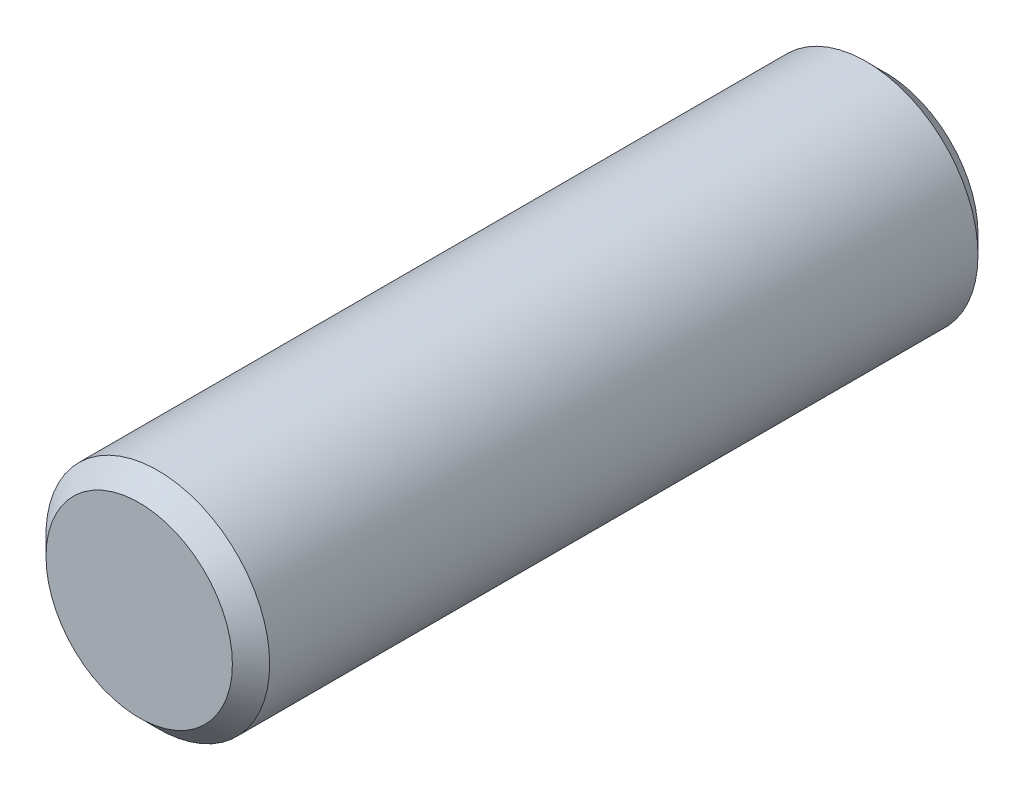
ISO-10303-21;
HEADER;
FILE_DESCRIPTION(('STEP AP214'),'2;1');
FILE_NAME('part.step','',(''),(''),'','','');
FILE_SCHEMA(('AUTOMOTIVE_DESIGN { 1 0 10303 214 1 1 1 1 }'));
ENDSEC;
DATA;
#1=APPLICATION_CONTEXT('core data for automotive mechanical design processes');
#2=APPLICATION_PROTOCOL_DEFINITION('international standard','automotive_design',2000,#1);
#3=PRODUCT_CONTEXT('',#1,'mechanical');
#4=PRODUCT('Part','Part','',(#3));
#5=PRODUCT_RELATED_PRODUCT_CATEGORY('part','',(#4));
#6=PRODUCT_DEFINITION_FORMATION('','',#4);
#7=PRODUCT_DEFINITION_CONTEXT('part definition',#1,'design');
#8=PRODUCT_DEFINITION('design','',#6,#7);
#9=PRODUCT_DEFINITION_SHAPE('','',#8);
#10=(LENGTH_UNIT() NAMED_UNIT(*) SI_UNIT(.MILLI.,.METRE.));
#11=(NAMED_UNIT(*) PLANE_ANGLE_UNIT() SI_UNIT($,.RADIAN.));
#12=(NAMED_UNIT(*) SI_UNIT($,.STERADIAN.) SOLID_ANGLE_UNIT());
#13=UNCERTAINTY_MEASURE_WITH_UNIT(LENGTH_MEASURE(1.E-05),#10,'distance_accuracy_value','');
#14=(GEOMETRIC_REPRESENTATION_CONTEXT(3) GLOBAL_UNCERTAINTY_ASSIGNED_CONTEXT((#13)) GLOBAL_UNIT_ASSIGNED_CONTEXT((#10,
#11,#12)) REPRESENTATION_CONTEXT('',''));
#15=CARTESIAN_POINT('',(0.,0.,0.));
#16=DIRECTION('',(0.,0.,1.));
#17=DIRECTION('',(1.,0.,0.));
#18=AXIS2_PLACEMENT_3D('',#15,#16,#17);
#19=CARTESIAN_POINT('',(0.,0.,4.));
#20=DIRECTION('',(0.,0.,-1.));
#21=DIRECTION('',(-1.,0.,0.));
#22=AXIS2_PLACEMENT_3D('',#19,#20,#21);
#23=CYLINDRICAL_SURFACE('',#22,0.6);
#24=CARTESIAN_POINT('',(0.,0.,0.1));
#25=DIRECTION('',(0.,0.,1.));
#26=DIRECTION('',(1.,0.,0.));
#27=AXIS2_PLACEMENT_3D('',#24,#25,#26);
#28=CIRCLE('',#27,0.6);
#29=CARTESIAN_POINT('',(0.6,0.,0.1));
#30=VERTEX_POINT('',#29);
#31=EDGE_CURVE('E360',#30,#30,#28,.T.);
#32=ORIENTED_EDGE('',*,*,#31,.T.);
#33=EDGE_LOOP('',(#32));
#34=FACE_BOUND('',#33,.T.);
#35=CARTESIAN_POINT('',(0.,0.,3.9));
#36=DIRECTION('',(0.,0.,1.));
#37=DIRECTION('',(1.,0.,0.));
#38=AXIS2_PLACEMENT_3D('',#35,#36,#37);
#39=CIRCLE('',#38,0.6);
#40=CARTESIAN_POINT('',(0.6,0.,3.9));
#41=VERTEX_POINT('',#40);
#42=EDGE_CURVE('E364',#41,#41,#39,.F.);
#43=ORIENTED_EDGE('',*,*,#42,.T.);
#44=EDGE_LOOP('',(#43));
#45=FACE_BOUND('',#44,.T.);
#46=ADVANCED_FACE('F350',(#34,#45),#23,.T.);
#47=CARTESIAN_POINT('',(0.,0.,4.));
#48=DIRECTION('',(0.,0.,1.));
#49=DIRECTION('',(1.,0.,0.));
#50=AXIS2_PLACEMENT_3D('',#47,#48,#49);
#51=PLANE('',#50);
#52=CARTESIAN_POINT('',(0.,0.,4.));
#53=DIRECTION('',(0.,0.,1.));
#54=DIRECTION('',(1.,0.,0.));
#55=AXIS2_PLACEMENT_3D('',#52,#53,#54);
#56=CIRCLE('',#55,0.5);
#57=CARTESIAN_POINT('',(0.5,0.,4.));
#58=VERTEX_POINT('',#57);
#59=EDGE_CURVE('E10',#58,#58,#56,.T.);
#60=ORIENTED_EDGE('',*,*,#59,.T.);
#61=EDGE_LOOP('',(#60));
#62=FACE_BOUND('',#61,.T.);
#63=ADVANCED_FACE('F383',(#62),#51,.T.);
#64=CARTESIAN_POINT('',(0.,0.,0.));
#65=DIRECTION('',(0.,0.,1.));
#66=DIRECTION('',(1.,0.,0.));
#67=AXIS2_PLACEMENT_3D('',#64,#65,#66);
#68=PLANE('',#67);
#69=CARTESIAN_POINT('',(0.,0.,0.));
#70=DIRECTION('',(0.,0.,1.));
#71=DIRECTION('',(1.,0.,0.));
#72=AXIS2_PLACEMENT_3D('',#69,#70,#71);
#73=CIRCLE('',#72,0.499999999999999);
#74=CARTESIAN_POINT('',(0.499999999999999,0.,0.));
#75=VERTEX_POINT('',#74);
#76=EDGE_CURVE('E356',#75,#75,#73,.F.);
#77=ORIENTED_EDGE('',*,*,#76,.T.);
#78=EDGE_LOOP('',(#77));
#79=FACE_BOUND('',#78,.T.);
#80=ADVANCED_FACE('F379',(#79),#68,.F.);
#81=CARTESIAN_POINT('',(0.,0.,0.1));
#82=DIRECTION('',(0.,0.,1.));
#83=DIRECTION('',(1.,0.,0.));
#84=AXIS2_PLACEMENT_3D('',#81,#82,#83);
#85=CONICAL_SURFACE('',#84,0.6,0.785398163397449);
#86=ORIENTED_EDGE('',*,*,#76,.F.);
#87=EDGE_LOOP('',(#86));
#88=FACE_BOUND('',#87,.T.);
#89=ORIENTED_EDGE('',*,*,#31,.F.);
#90=EDGE_LOOP('',(#89));
#91=FACE_BOUND('',#90,.T.);
#92=ADVANCED_FACE('F374',(#88,#91),#85,.T.);
#93=CARTESIAN_POINT('',(0.,0.,4.));
#94=DIRECTION('',(0.,0.,-1.));
#95=DIRECTION('',(-1.,0.,0.));
#96=AXIS2_PLACEMENT_3D('',#93,#94,#95);
#97=CONICAL_SURFACE('',#96,0.5,0.785398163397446);
#98=ORIENTED_EDGE('',*,*,#42,.F.);
#99=EDGE_LOOP('',(#98));
#100=FACE_BOUND('',#99,.T.);
#101=ORIENTED_EDGE('',*,*,#59,.F.);
#102=EDGE_LOOP('',(#101));
#103=FACE_BOUND('',#102,.T.);
#104=ADVANCED_FACE('F371',(#100,#103),#97,.T.);
#105=CLOSED_SHELL('',(#46,#63,#80,#92,#104));
#106=MANIFOLD_SOLID_BREP('B2',#105);
#107=ADVANCED_BREP_SHAPE_REPRESENTATION('',(#18,#106),#14);
#108=SHAPE_DEFINITION_REPRESENTATION(#9,#107);
ENDSEC;
END-ISO-10303-21;
